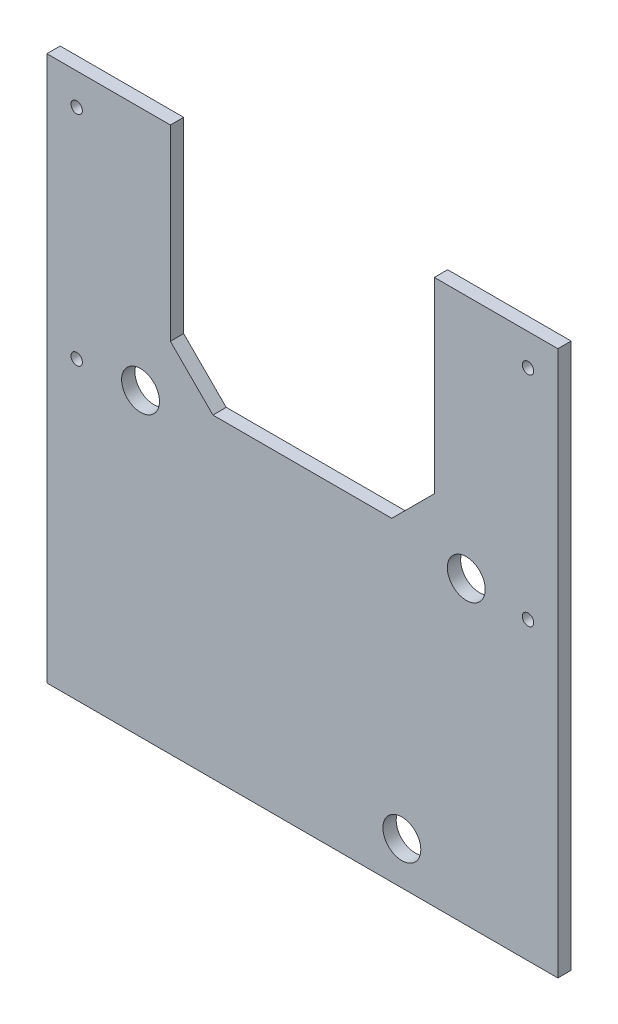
ISO-10303-21;
HEADER;
FILE_DESCRIPTION(('STEP AP214'),'2;1');
FILE_NAME('part.step','',(''),(''),'','','');
FILE_SCHEMA(('AUTOMOTIVE_DESIGN { 1 0 10303 214 1 1 1 1 }'));
ENDSEC;
DATA;
#1=APPLICATION_CONTEXT('core data for automotive mechanical design processes');
#2=APPLICATION_PROTOCOL_DEFINITION('international standard','automotive_design',2000,#1);
#3=PRODUCT_CONTEXT('',#1,'mechanical');
#4=PRODUCT('Part','Part','',(#3));
#5=PRODUCT_RELATED_PRODUCT_CATEGORY('part','',(#4));
#6=PRODUCT_DEFINITION_FORMATION('','',#4);
#7=PRODUCT_DEFINITION_CONTEXT('part definition',#1,'design');
#8=PRODUCT_DEFINITION('design','',#6,#7);
#9=PRODUCT_DEFINITION_SHAPE('','',#8);
#10=(LENGTH_UNIT() NAMED_UNIT(*) SI_UNIT(.MILLI.,.METRE.));
#11=(NAMED_UNIT(*) PLANE_ANGLE_UNIT() SI_UNIT($,.RADIAN.));
#12=(NAMED_UNIT(*) SI_UNIT($,.STERADIAN.) SOLID_ANGLE_UNIT());
#13=UNCERTAINTY_MEASURE_WITH_UNIT(LENGTH_MEASURE(1.E-05),#10,'distance_accuracy_value','');
#14=(GEOMETRIC_REPRESENTATION_CONTEXT(3) GLOBAL_UNCERTAINTY_ASSIGNED_CONTEXT((#13)) GLOBAL_UNIT_ASSIGNED_CONTEXT((#10,
#11,#12)) REPRESENTATION_CONTEXT('',''));
#15=CARTESIAN_POINT('',(0.,0.,0.));
#16=DIRECTION('',(0.,0.,1.));
#17=DIRECTION('',(1.,0.,0.));
#18=AXIS2_PLACEMENT_3D('',#15,#16,#17);
#19=CARTESIAN_POINT('',(-15.24,5.84200000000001,0.));
#20=DIRECTION('',(0.,-1.,0.));
#21=DIRECTION('',(0.,0.,-0.999999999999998));
#22=AXIS2_PLACEMENT_3D('',#19,#20,#21);
#23=PLANE('',#22);
#24=DIRECTION('',(1.,0.,0.));
#25=VECTOR('',#24,1.);
#26=CARTESIAN_POINT('',(-15.24,5.84200000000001,0.793749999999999));
#27=LINE('',#26,#25);
#28=CARTESIAN_POINT('',(-15.24,5.84200000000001,0.793749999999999));
#29=VERTEX_POINT('',#28);
#30=CARTESIAN_POINT('',(-7.87399999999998,5.842,0.79375));
#31=VERTEX_POINT('',#30);
#32=EDGE_CURVE('E210',#29,#31,#27,.T.);
#33=ORIENTED_EDGE('',*,*,#32,.T.);
#34=DIRECTION('',(0.,0.,0.999999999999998));
#35=VECTOR('',#34,1.);
#36=CARTESIAN_POINT('',(-7.87400000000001,5.84200000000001,0.));
#37=LINE('',#36,#35);
#38=CARTESIAN_POINT('',(-7.87400000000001,5.84200000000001,0.));
#39=VERTEX_POINT('',#38);
#40=EDGE_CURVE('E203',#39,#31,#37,.T.);
#41=ORIENTED_EDGE('',*,*,#40,.F.);
#42=DIRECTION('',(1.,0.,0.));
#43=VECTOR('',#42,1.);
#44=CARTESIAN_POINT('',(-15.24,5.84200000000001,0.));
#45=LINE('',#44,#43);
#46=CARTESIAN_POINT('',(-15.24,5.84200000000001,0.));
#47=VERTEX_POINT('',#46);
#48=EDGE_CURVE('E215',#47,#39,#45,.T.);
#49=ORIENTED_EDGE('',*,*,#48,.F.);
#50=DIRECTION('',(0.,0.,0.999999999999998));
#51=VECTOR('',#50,1.);
#52=CARTESIAN_POINT('',(-15.24,5.84200000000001,0.));
#53=LINE('',#52,#51);
#54=EDGE_CURVE('E219',#47,#29,#53,.T.);
#55=ORIENTED_EDGE('',*,*,#54,.T.);
#56=EDGE_LOOP('',(#33,#41,#49,#55));
#57=FACE_BOUND('',#56,.T.);
#58=ADVANCED_FACE('F42',(#57),#23,.F.);
#59=CARTESIAN_POINT('',(-15.24,-20.32,0.793749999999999));
#60=DIRECTION('',(1.,0.,0.));
#61=DIRECTION('',(0.,0.,-0.999999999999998));
#62=AXIS2_PLACEMENT_3D('',#59,#60,#61);
#63=PLANE('',#62);
#64=DIRECTION('',(0.,-1.,0.));
#65=VECTOR('',#64,1.);
#66=CARTESIAN_POINT('',(-15.24,15.24,0.79375));
#67=LINE('',#66,#65);
#68=CARTESIAN_POINT('',(-15.24,-26.67,0.793749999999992));
#69=VERTEX_POINT('',#68);
#70=EDGE_CURVE('E151',#29,#69,#67,.T.);
#71=ORIENTED_EDGE('',*,*,#70,.F.);
#72=ORIENTED_EDGE('',*,*,#54,.F.);
#73=DIRECTION('',(0.,-1.,0.));
#74=VECTOR('',#73,1.);
#75=CARTESIAN_POINT('',(-15.24,-20.32,0.));
#76=LINE('',#75,#74);
#77=CARTESIAN_POINT('',(-15.24,-26.67,0.));
#78=VERTEX_POINT('',#77);
#79=EDGE_CURVE('E222',#47,#78,#76,.T.);
#80=ORIENTED_EDGE('',*,*,#79,.T.);
#81=DIRECTION('',(0.,0.,-0.999999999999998));
#82=VECTOR('',#81,1.);
#83=CARTESIAN_POINT('',(-15.24,-26.67,0.793749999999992));
#84=LINE('',#83,#82);
#85=EDGE_CURVE('E162',#69,#78,#84,.T.);
#86=ORIENTED_EDGE('',*,*,#85,.F.);
#87=EDGE_LOOP('',(#71,#72,#80,#86));
#88=FACE_BOUND('',#87,.T.);
#89=ADVANCED_FACE('F306',(#88),#63,.F.);
#90=CARTESIAN_POINT('',(15.24,15.24,0.793750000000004));
#91=DIRECTION('',(-1.,0.,0.));
#92=DIRECTION('',(0.,-1.,0.));
#93=AXIS2_PLACEMENT_3D('',#90,#91,#92);
#94=PLANE('',#93);
#95=DIRECTION('',(0.,1.,0.));
#96=VECTOR('',#95,1.);
#97=CARTESIAN_POINT('',(15.24,15.24,0.));
#98=LINE('',#97,#96);
#99=CARTESIAN_POINT('',(15.24,-26.67,0.));
#100=VERTEX_POINT('',#99);
#101=CARTESIAN_POINT('',(15.24,5.842,0.));
#102=VERTEX_POINT('',#101);
#103=EDGE_CURVE('E227',#100,#102,#98,.T.);
#104=ORIENTED_EDGE('',*,*,#103,.T.);
#105=DIRECTION('',(0.,0.,0.999999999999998));
#106=VECTOR('',#105,1.);
#107=CARTESIAN_POINT('',(15.24,5.84200000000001,0.));
#108=LINE('',#107,#106);
#109=CARTESIAN_POINT('',(15.24,5.84200000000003,0.79375));
#110=VERTEX_POINT('',#109);
#111=EDGE_CURVE('E147',#102,#110,#108,.T.);
#112=ORIENTED_EDGE('',*,*,#111,.T.);
#113=DIRECTION('',(0.,1.,0.));
#114=VECTOR('',#113,1.);
#115=CARTESIAN_POINT('',(15.24,-15.24,0.793749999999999));
#116=LINE('',#115,#114);
#117=CARTESIAN_POINT('',(15.24,-26.67,0.793749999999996));
#118=VERTEX_POINT('',#117);
#119=EDGE_CURVE('E140',#118,#110,#116,.T.);
#120=ORIENTED_EDGE('',*,*,#119,.F.);
#121=DIRECTION('',(0.,0.,0.999999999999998));
#122=VECTOR('',#121,1.);
#123=CARTESIAN_POINT('',(15.24,-26.67,0.793749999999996));
#124=LINE('',#123,#122);
#125=EDGE_CURVE('E145',#100,#118,#124,.T.);
#126=ORIENTED_EDGE('',*,*,#125,.F.);
#127=EDGE_LOOP('',(#104,#112,#120,#126));
#128=FACE_BOUND('',#127,.T.);
#129=ADVANCED_FACE('F143',(#128),#94,.F.);
#130=CARTESIAN_POINT('',(-15.24,15.24,0.79375));
#131=DIRECTION('',(0.,0.,0.999999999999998));
#132=DIRECTION('',(1.,0.,0.));
#133=AXIS2_PLACEMENT_3D('',#130,#131,#132);
#134=PLANE('',#133);
#135=CARTESIAN_POINT('',(-13.462,-9.04000000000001,0.793749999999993));
#136=DIRECTION('',(0.,0.,0.999999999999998));
#137=DIRECTION('',(1.,0.,0.));
#138=AXIS2_PLACEMENT_3D('',#135,#136,#137);
#139=CIRCLE('',#138,0.339377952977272);
#140=CARTESIAN_POINT('',(-13.1226220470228,-9.04000000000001,0.793749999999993));
#141=VERTEX_POINT('',#140);
#142=EDGE_CURVE('E258',#141,#141,#139,.T.);
#143=ORIENTED_EDGE('',*,*,#142,.F.);
#144=EDGE_LOOP('',(#143));
#145=FACE_BOUND('',#144,.T.);
#146=CARTESIAN_POINT('',(-13.462,3.96000000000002,0.793749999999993));
#147=DIRECTION('',(0.,0.,0.999999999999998));
#148=DIRECTION('',(1.,0.,0.));
#149=AXIS2_PLACEMENT_3D('',#146,#147,#148);
#150=CIRCLE('',#149,0.339377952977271);
#151=CARTESIAN_POINT('',(-13.1226220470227,3.96000000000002,0.793749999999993));
#152=VERTEX_POINT('',#151);
#153=EDGE_CURVE('E257',#152,#152,#150,.T.);
#154=ORIENTED_EDGE('',*,*,#153,.F.);
#155=EDGE_LOOP('',(#154));
#156=FACE_BOUND('',#155,.T.);
#157=CARTESIAN_POINT('',(13.462,3.96000000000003,0.793749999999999));
#158=DIRECTION('',(0.,0.,0.999999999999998));
#159=DIRECTION('',(1.,0.,0.));
#160=AXIS2_PLACEMENT_3D('',#157,#158,#159);
#161=CIRCLE('',#160,0.339377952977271);
#162=CARTESIAN_POINT('',(13.8013779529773,3.96000000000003,0.793749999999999));
#163=VERTEX_POINT('',#162);
#164=EDGE_CURVE('E268',#163,#163,#161,.T.);
#165=ORIENTED_EDGE('',*,*,#164,.F.);
#166=EDGE_LOOP('',(#165));
#167=FACE_BOUND('',#166,.T.);
#168=CARTESIAN_POINT('',(13.462,-9.03999999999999,0.793749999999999));
#169=DIRECTION('',(0.,0.,0.999999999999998));
#170=DIRECTION('',(1.,0.,0.));
#171=AXIS2_PLACEMENT_3D('',#168,#169,#170);
#172=CIRCLE('',#171,0.339377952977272);
#173=CARTESIAN_POINT('',(13.8013779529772,-9.04000000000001,0.793749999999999));
#174=VERTEX_POINT('',#173);
#175=EDGE_CURVE('E267',#174,#174,#172,.T.);
#176=ORIENTED_EDGE('',*,*,#175,.F.);
#177=EDGE_LOOP('',(#176));
#178=FACE_BOUND('',#177,.T.);
#179=CARTESIAN_POINT('',(9.77899999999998,-8.76299999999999,0.793749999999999));
#180=DIRECTION('',(0.,0.,0.999999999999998));
#181=DIRECTION('',(1.,0.,0.));
#182=AXIS2_PLACEMENT_3D('',#179,#180,#181);
#183=CIRCLE('',#182,1.1303);
#184=CARTESIAN_POINT('',(10.9093,-8.76299999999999,0.793749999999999));
#185=VERTEX_POINT('',#184);
#186=EDGE_CURVE('E506',#185,#185,#183,.T.);
#187=ORIENTED_EDGE('',*,*,#186,.F.);
#188=EDGE_LOOP('',(#187));
#189=FACE_BOUND('',#188,.T.);
#190=CARTESIAN_POINT('',(5.93598000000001,-24.13,0.793749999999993));
#191=DIRECTION('',(0.,0.,0.999999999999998));
#192=DIRECTION('',(1.,0.,0.));
#193=AXIS2_PLACEMENT_3D('',#190,#191,#192);
#194=CIRCLE('',#193,1.1303);
#195=CARTESIAN_POINT('',(7.06628000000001,-24.13,0.793749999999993));
#196=VERTEX_POINT('',#195);
#197=EDGE_CURVE('E252',#196,#196,#194,.T.);
#198=ORIENTED_EDGE('',*,*,#197,.F.);
#199=EDGE_LOOP('',(#198));
#200=FACE_BOUND('',#199,.T.);
#201=CARTESIAN_POINT('',(-9.652,-8.76300000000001,0.793749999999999));
#202=DIRECTION('',(0.,0.,0.999999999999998));
#203=DIRECTION('',(1.,0.,0.));
#204=AXIS2_PLACEMENT_3D('',#201,#202,#203);
#205=CIRCLE('',#204,1.1303);
#206=CARTESIAN_POINT('',(-8.5217,-8.76300000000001,0.793749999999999));
#207=VERTEX_POINT('',#206);
#208=EDGE_CURVE('E169',#207,#207,#205,.T.);
#209=ORIENTED_EDGE('',*,*,#208,.F.);
#210=EDGE_LOOP('',(#209));
#211=FACE_BOUND('',#210,.T.);
#212=DIRECTION('',(0.,-1.,0.));
#213=VECTOR('',#212,1.);
#214=CARTESIAN_POINT('',(-7.87399999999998,5.842,0.79375));
#215=LINE('',#214,#213);
#216=CARTESIAN_POINT('',(-7.87400000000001,-5.334,0.79375));
#217=VERTEX_POINT('',#216);
#218=EDGE_CURVE('E182',#31,#217,#215,.T.);
#219=ORIENTED_EDGE('',*,*,#218,.F.);
#220=ORIENTED_EDGE('',*,*,#32,.F.);
#221=ORIENTED_EDGE('',*,*,#70,.T.);
#222=DIRECTION('',(-1.,0.,0.));
#223=VECTOR('',#222,1.);
#224=CARTESIAN_POINT('',(15.24,-26.67,0.793749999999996));
#225=LINE('',#224,#223);
#226=EDGE_CURVE('E154',#118,#69,#225,.T.);
#227=ORIENTED_EDGE('',*,*,#226,.F.);
#228=ORIENTED_EDGE('',*,*,#119,.T.);
#229=CARTESIAN_POINT('',(7.87400000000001,5.842,0.793749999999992));
#230=VERTEX_POINT('',#229);
#231=EDGE_CURVE('E206',#230,#110,#27,.T.);
#232=ORIENTED_EDGE('',*,*,#231,.F.);
#233=DIRECTION('',(0.,1.,0.));
#234=VECTOR('',#233,1.);
#235=CARTESIAN_POINT('',(7.87400000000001,5.842,0.793749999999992));
#236=LINE('',#235,#234);
#237=CARTESIAN_POINT('',(7.87399999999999,-5.33399999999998,0.793749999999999));
#238=VERTEX_POINT('',#237);
#239=EDGE_CURVE('E189',#238,#230,#236,.T.);
#240=ORIENTED_EDGE('',*,*,#239,.F.);
#241=DIRECTION('',(0.707106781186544,0.707106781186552,0.));
#242=VECTOR('',#241,1.);
#243=CARTESIAN_POINT('',(7.87399999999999,-5.33399999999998,0.793749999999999));
#244=LINE('',#243,#242);
#245=CARTESIAN_POINT('',(5.33400000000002,-7.87400000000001,0.793750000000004));
#246=VERTEX_POINT('',#245);
#247=EDGE_CURVE('E244',#238,#246,#244,.F.);
#248=ORIENTED_EDGE('',*,*,#247,.T.);
#249=DIRECTION('',(1.,0.,0.));
#250=VECTOR('',#249,1.);
#251=CARTESIAN_POINT('',(-7.874,-7.87399999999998,0.793749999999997));
#252=LINE('',#251,#250);
#253=CARTESIAN_POINT('',(-5.334,-7.87399999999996,0.793749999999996));
#254=VERTEX_POINT('',#253);
#255=EDGE_CURVE('E185',#254,#246,#252,.T.);
#256=ORIENTED_EDGE('',*,*,#255,.F.);
#257=DIRECTION('',(0.707106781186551,-0.707106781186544,0.));
#258=VECTOR('',#257,1.);
#259=CARTESIAN_POINT('',(-5.334,-7.87399999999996,0.793749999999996));
#260=LINE('',#259,#258);
#261=EDGE_CURVE('E51',#254,#217,#260,.F.);
#262=ORIENTED_EDGE('',*,*,#261,.T.);
#263=EDGE_LOOP('',(#219,#220,#221,#227,#228,#232,#240,#248,#256,#262));
#264=FACE_BOUND('',#263,.T.);
#265=ADVANCED_FACE('F155',(#145,#156,#167,#178,#189,#200,#211,#264),#134,.T.);
#266=CARTESIAN_POINT('',(-15.24,15.24,0.));
#267=DIRECTION('',(0.,0.,0.999999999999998));
#268=DIRECTION('',(1.,0.,0.));
#269=AXIS2_PLACEMENT_3D('',#266,#267,#268);
#270=PLANE('',#269);
#271=CARTESIAN_POINT('',(-13.462,-9.04000000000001,0.));
#272=DIRECTION('',(0.,0.,0.999999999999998));
#273=DIRECTION('',(1.,0.,0.));
#274=AXIS2_PLACEMENT_3D('',#271,#272,#273);
#275=CIRCLE('',#274,0.339377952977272);
#276=CARTESIAN_POINT('',(-13.1226220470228,-9.04000000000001,0.));
#277=VERTEX_POINT('',#276);
#278=EDGE_CURVE('E254',#277,#277,#275,.T.);
#279=ORIENTED_EDGE('',*,*,#278,.T.);
#280=EDGE_LOOP('',(#279));
#281=FACE_BOUND('',#280,.T.);
#282=CARTESIAN_POINT('',(-13.462,3.96000000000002,0.));
#283=DIRECTION('',(0.,0.,0.999999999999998));
#284=DIRECTION('',(1.,0.,0.));
#285=AXIS2_PLACEMENT_3D('',#282,#283,#284);
#286=CIRCLE('',#285,0.339377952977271);
#287=CARTESIAN_POINT('',(-13.1226220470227,3.96000000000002,0.));
#288=VERTEX_POINT('',#287);
#289=EDGE_CURVE('E271',#288,#288,#286,.T.);
#290=ORIENTED_EDGE('',*,*,#289,.T.);
#291=EDGE_LOOP('',(#290));
#292=FACE_BOUND('',#291,.T.);
#293=CARTESIAN_POINT('',(13.462,3.96000000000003,0.));
#294=DIRECTION('',(0.,0.,0.999999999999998));
#295=DIRECTION('',(1.,0.,0.));
#296=AXIS2_PLACEMENT_3D('',#293,#294,#295);
#297=CIRCLE('',#296,0.339377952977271);
#298=CARTESIAN_POINT('',(13.8013779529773,3.96000000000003,0.));
#299=VERTEX_POINT('',#298);
#300=EDGE_CURVE('E264',#299,#299,#297,.T.);
#301=ORIENTED_EDGE('',*,*,#300,.T.);
#302=EDGE_LOOP('',(#301));
#303=FACE_BOUND('',#302,.T.);
#304=CARTESIAN_POINT('',(13.462,-9.04000000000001,0.));
#305=DIRECTION('',(0.,0.,0.999999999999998));
#306=DIRECTION('',(1.,0.,0.));
#307=AXIS2_PLACEMENT_3D('',#304,#305,#306);
#308=CIRCLE('',#307,0.339377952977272);
#309=CARTESIAN_POINT('',(13.8013779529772,-9.04000000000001,0.));
#310=VERTEX_POINT('',#309);
#311=EDGE_CURVE('E526',#310,#310,#308,.T.);
#312=ORIENTED_EDGE('',*,*,#311,.T.);
#313=EDGE_LOOP('',(#312));
#314=FACE_BOUND('',#313,.T.);
#315=CARTESIAN_POINT('',(9.77899999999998,-8.76299999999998,0.));
#316=DIRECTION('',(0.,0.,0.999999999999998));
#317=DIRECTION('',(1.,0.,0.));
#318=AXIS2_PLACEMENT_3D('',#315,#316,#317);
#319=CIRCLE('',#318,1.1303);
#320=CARTESIAN_POINT('',(10.9093,-8.76299999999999,0.));
#321=VERTEX_POINT('',#320);
#322=EDGE_CURVE('E522',#321,#321,#319,.T.);
#323=ORIENTED_EDGE('',*,*,#322,.T.);
#324=EDGE_LOOP('',(#323));
#325=FACE_BOUND('',#324,.T.);
#326=CARTESIAN_POINT('',(5.93597999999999,-24.13,0.));
#327=DIRECTION('',(0.,0.,0.999999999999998));
#328=DIRECTION('',(1.,0.,0.));
#329=AXIS2_PLACEMENT_3D('',#326,#327,#328);
#330=CIRCLE('',#329,1.1303);
#331=CARTESIAN_POINT('',(7.06628000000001,-24.13,0.));
#332=VERTEX_POINT('',#331);
#333=EDGE_CURVE('E514',#332,#332,#330,.T.);
#334=ORIENTED_EDGE('',*,*,#333,.T.);
#335=EDGE_LOOP('',(#334));
#336=FACE_BOUND('',#335,.T.);
#337=CARTESIAN_POINT('',(-9.65200000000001,-8.76299999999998,0.));
#338=DIRECTION('',(0.,0.,0.999999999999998));
#339=DIRECTION('',(1.,0.,0.));
#340=AXIS2_PLACEMENT_3D('',#337,#338,#339);
#341=CIRCLE('',#340,1.1303);
#342=CARTESIAN_POINT('',(-8.5217,-8.76300000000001,0.));
#343=VERTEX_POINT('',#342);
#344=EDGE_CURVE('E174',#343,#343,#341,.T.);
#345=ORIENTED_EDGE('',*,*,#344,.T.);
#346=EDGE_LOOP('',(#345));
#347=FACE_BOUND('',#346,.T.);
#348=ORIENTED_EDGE('',*,*,#48,.T.);
#349=DIRECTION('',(0.,-1.,0.));
#350=VECTOR('',#349,1.);
#351=CARTESIAN_POINT('',(-7.87400000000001,5.84200000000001,0.));
#352=LINE('',#351,#350);
#353=CARTESIAN_POINT('',(-7.87400000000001,-5.334,0.));
#354=VERTEX_POINT('',#353);
#355=EDGE_CURVE('E192',#39,#354,#352,.T.);
#356=ORIENTED_EDGE('',*,*,#355,.T.);
#357=DIRECTION('',(-0.707106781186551,0.707106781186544,0.));
#358=VECTOR('',#357,1.);
#359=CARTESIAN_POINT('',(-21.8440000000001,8.63599999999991,0.));
#360=LINE('',#359,#358);
#361=CARTESIAN_POINT('',(-5.334,-7.87399999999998,0.));
#362=VERTEX_POINT('',#361);
#363=EDGE_CURVE('E11',#354,#362,#360,.F.);
#364=ORIENTED_EDGE('',*,*,#363,.T.);
#365=DIRECTION('',(1.,0.,0.));
#366=VECTOR('',#365,1.);
#367=CARTESIAN_POINT('',(-7.87400000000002,-7.87399999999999,0.));
#368=LINE('',#367,#366);
#369=CARTESIAN_POINT('',(5.33399999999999,-7.87399999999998,0.));
#370=VERTEX_POINT('',#369);
#371=EDGE_CURVE('E195',#362,#370,#368,.T.);
#372=ORIENTED_EDGE('',*,*,#371,.T.);
#373=DIRECTION('',(-0.707106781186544,-0.707106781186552,0.));
#374=VECTOR('',#373,1.);
#375=CARTESIAN_POINT('',(6.60400000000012,-6.60399999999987,0.));
#376=LINE('',#375,#374);
#377=CARTESIAN_POINT('',(7.87399999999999,-5.33399999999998,0.));
#378=VERTEX_POINT('',#377);
#379=EDGE_CURVE('E247',#370,#378,#376,.F.);
#380=ORIENTED_EDGE('',*,*,#379,.T.);
#381=DIRECTION('',(0.,1.,0.));
#382=VECTOR('',#381,1.);
#383=CARTESIAN_POINT('',(7.87399999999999,5.842,0.));
#384=LINE('',#383,#382);
#385=CARTESIAN_POINT('',(7.87399999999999,5.842,0.));
#386=VERTEX_POINT('',#385);
#387=EDGE_CURVE('E199',#378,#386,#384,.T.);
#388=ORIENTED_EDGE('',*,*,#387,.T.);
#389=EDGE_CURVE('E214',#386,#102,#45,.T.);
#390=ORIENTED_EDGE('',*,*,#389,.T.);
#391=ORIENTED_EDGE('',*,*,#103,.F.);
#392=DIRECTION('',(1.,0.,0.));
#393=VECTOR('',#392,1.);
#394=CARTESIAN_POINT('',(15.24,-26.67,0.));
#395=LINE('',#394,#393);
#396=EDGE_CURVE('E167',#78,#100,#395,.T.);
#397=ORIENTED_EDGE('',*,*,#396,.F.);
#398=ORIENTED_EDGE('',*,*,#79,.F.);
#399=EDGE_LOOP('',(#348,#356,#364,#372,#380,#388,#390,#391,#397,#398));
#400=FACE_BOUND('',#399,.T.);
#401=ADVANCED_FACE('F281',(#281,#292,#303,#314,#325,#336,#347,#400),#270,.F.);
#402=ORIENTED_EDGE('',*,*,#389,.F.);
#403=DIRECTION('',(0.,0.,0.999999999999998));
#404=VECTOR('',#403,1.);
#405=CARTESIAN_POINT('',(7.87399999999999,5.842,0.));
#406=LINE('',#405,#404);
#407=EDGE_CURVE('E202',#386,#230,#406,.T.);
#408=ORIENTED_EDGE('',*,*,#407,.T.);
#409=ORIENTED_EDGE('',*,*,#231,.T.);
#410=ORIENTED_EDGE('',*,*,#111,.F.);
#411=EDGE_LOOP('',(#402,#408,#409,#410));
#412=FACE_BOUND('',#411,.T.);
#413=ADVANCED_FACE('F285',(#412),#23,.F.);
#414=CARTESIAN_POINT('',(-7.87400000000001,5.84200000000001,0.));
#415=DIRECTION('',(-1.,0.,0.));
#416=DIRECTION('',(0.,0.,0.999999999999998));
#417=AXIS2_PLACEMENT_3D('',#414,#415,#416);
#418=PLANE('',#417);
#419=ORIENTED_EDGE('',*,*,#218,.T.);
#420=DIRECTION('',(0.,0.,-0.999999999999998));
#421=VECTOR('',#420,1.);
#422=CARTESIAN_POINT('',(-7.87400000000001,-5.334,0.));
#423=LINE('',#422,#421);
#424=EDGE_CURVE('E61',#217,#354,#423,.T.);
#425=ORIENTED_EDGE('',*,*,#424,.T.);
#426=ORIENTED_EDGE('',*,*,#355,.F.);
#427=ORIENTED_EDGE('',*,*,#40,.T.);
#428=EDGE_LOOP('',(#419,#425,#426,#427));
#429=FACE_BOUND('',#428,.T.);
#430=ADVANCED_FACE('F317',(#429),#418,.F.);
#431=CARTESIAN_POINT('',(7.87399999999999,5.842,0.));
#432=DIRECTION('',(1.,0.,0.));
#433=DIRECTION('',(0.,0.,-0.999999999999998));
#434=AXIS2_PLACEMENT_3D('',#431,#432,#433);
#435=PLANE('',#434);
#436=ORIENTED_EDGE('',*,*,#387,.F.);
#437=DIRECTION('',(0.,0.,0.999999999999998));
#438=VECTOR('',#437,1.);
#439=CARTESIAN_POINT('',(7.87399999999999,-5.33399999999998,0.793749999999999));
#440=LINE('',#439,#438);
#441=EDGE_CURVE('E150',#378,#238,#440,.T.);
#442=ORIENTED_EDGE('',*,*,#441,.T.);
#443=ORIENTED_EDGE('',*,*,#239,.T.);
#444=ORIENTED_EDGE('',*,*,#407,.F.);
#445=EDGE_LOOP('',(#436,#442,#443,#444));
#446=FACE_BOUND('',#445,.T.);
#447=ADVANCED_FACE('F288',(#446),#435,.F.);
#448=CARTESIAN_POINT('',(-7.87400000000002,-7.87399999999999,0.));
#449=DIRECTION('',(0.,-1.,0.));
#450=DIRECTION('',(0.,0.,-0.999999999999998));
#451=AXIS2_PLACEMENT_3D('',#448,#449,#450);
#452=PLANE('',#451);
#453=ORIENTED_EDGE('',*,*,#255,.T.);
#454=DIRECTION('',(0.,0.,-0.999999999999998));
#455=VECTOR('',#454,1.);
#456=CARTESIAN_POINT('',(5.33399999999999,-7.87399999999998,0.));
#457=LINE('',#456,#455);
#458=EDGE_CURVE('E239',#246,#370,#457,.T.);
#459=ORIENTED_EDGE('',*,*,#458,.T.);
#460=ORIENTED_EDGE('',*,*,#371,.F.);
#461=DIRECTION('',(0.,0.,0.999999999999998));
#462=VECTOR('',#461,1.);
#463=CARTESIAN_POINT('',(-5.334,-7.87399999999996,0.793749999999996));
#464=LINE('',#463,#462);
#465=EDGE_CURVE('E235',#362,#254,#464,.T.);
#466=ORIENTED_EDGE('',*,*,#465,.T.);
#467=EDGE_LOOP('',(#453,#459,#460,#466));
#468=FACE_BOUND('',#467,.T.);
#469=ADVANCED_FACE('F296',(#468),#452,.F.);
#470=CARTESIAN_POINT('',(15.24,-26.67,0.));
#471=DIRECTION('',(0.,1.,0.));
#472=DIRECTION('',(0.,0.,0.999999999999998));
#473=AXIS2_PLACEMENT_3D('',#470,#471,#472);
#474=PLANE('',#473);
#475=ORIENTED_EDGE('',*,*,#125,.T.);
#476=ORIENTED_EDGE('',*,*,#226,.T.);
#477=ORIENTED_EDGE('',*,*,#85,.T.);
#478=ORIENTED_EDGE('',*,*,#396,.T.);
#479=EDGE_LOOP('',(#475,#476,#477,#478));
#480=FACE_BOUND('',#479,.T.);
#481=ADVANCED_FACE('F165',(#480),#474,.F.);
#482=CARTESIAN_POINT('',(-9.652,-8.76300000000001,0.793749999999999));
#483=DIRECTION('',(0.,0.,0.999999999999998));
#484=DIRECTION('',(1.,0.,0.));
#485=AXIS2_PLACEMENT_3D('',#482,#483,#484);
#486=CYLINDRICAL_SURFACE('',#485,1.1303);
#487=CARTESIAN_POINT('',(-8.5217,-8.76300000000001,0.));
#488=CARTESIAN_POINT('',(-8.5217,-8.76300000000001,0.00826822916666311));
#489=CARTESIAN_POINT('',(-8.5217,-8.76300000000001,0.0165364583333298));
#490=CARTESIAN_POINT('',(-8.5217,-8.76300000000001,0.0330729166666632));
#491=CARTESIAN_POINT('',(-8.5217,-8.76300000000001,0.04134114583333));
#492=CARTESIAN_POINT('',(-8.5217,-8.76300000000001,0.0578776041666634));
#493=CARTESIAN_POINT('',(-8.5217,-8.76300000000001,0.06614583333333));
#494=CARTESIAN_POINT('',(-8.5217,-8.76300000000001,0.0826822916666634));
#495=CARTESIAN_POINT('',(-8.5217,-8.76300000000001,0.0909505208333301));
#496=CARTESIAN_POINT('',(-8.5217,-8.76300000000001,0.107486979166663));
#497=CARTESIAN_POINT('',(-8.5217,-8.76300000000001,0.11575520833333));
#498=CARTESIAN_POINT('',(-8.5217,-8.76300000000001,0.132291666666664));
#499=CARTESIAN_POINT('',(-8.5217,-8.76300000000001,0.14055989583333));
#500=CARTESIAN_POINT('',(-8.5217,-8.76300000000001,0.157096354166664));
#501=CARTESIAN_POINT('',(-8.5217,-8.76300000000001,0.16536458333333));
#502=CARTESIAN_POINT('',(-8.5217,-8.76300000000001,0.181901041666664));
#503=CARTESIAN_POINT('',(-8.5217,-8.76300000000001,0.19016927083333));
#504=CARTESIAN_POINT('',(-8.5217,-8.76300000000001,0.206705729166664));
#505=CARTESIAN_POINT('',(-8.5217,-8.76300000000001,0.214973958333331));
#506=CARTESIAN_POINT('',(-8.5217,-8.76300000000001,0.231510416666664));
#507=CARTESIAN_POINT('',(-8.5217,-8.76300000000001,0.239778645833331));
#508=CARTESIAN_POINT('',(-8.5217,-8.76300000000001,0.256315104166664));
#509=CARTESIAN_POINT('',(-8.5217,-8.76300000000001,0.264583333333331));
#510=CARTESIAN_POINT('',(-8.5217,-8.76300000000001,0.281119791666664));
#511=CARTESIAN_POINT('',(-8.5217,-8.76300000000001,0.289388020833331));
#512=CARTESIAN_POINT('',(-8.5217,-8.76300000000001,0.305924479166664));
#513=CARTESIAN_POINT('',(-8.5217,-8.76300000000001,0.314192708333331));
#514=CARTESIAN_POINT('',(-8.5217,-8.76300000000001,0.330729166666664));
#515=CARTESIAN_POINT('',(-8.5217,-8.76300000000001,0.338997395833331));
#516=CARTESIAN_POINT('',(-8.5217,-8.76300000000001,0.355533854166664));
#517=CARTESIAN_POINT('',(-8.5217,-8.76300000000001,0.363802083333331));
#518=CARTESIAN_POINT('',(-8.5217,-8.76300000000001,0.380338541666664));
#519=CARTESIAN_POINT('',(-8.5217,-8.76300000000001,0.388606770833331));
#520=CARTESIAN_POINT('',(-8.5217,-8.76300000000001,0.405143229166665));
#521=CARTESIAN_POINT('',(-8.5217,-8.76300000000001,0.413411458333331));
#522=CARTESIAN_POINT('',(-8.5217,-8.76300000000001,0.429947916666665));
#523=CARTESIAN_POINT('',(-8.5217,-8.76300000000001,0.438216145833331));
#524=CARTESIAN_POINT('',(-8.5217,-8.76300000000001,0.454752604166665));
#525=CARTESIAN_POINT('',(-8.5217,-8.76300000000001,0.463020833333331));
#526=CARTESIAN_POINT('',(-8.5217,-8.76300000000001,0.479557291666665));
#527=CARTESIAN_POINT('',(-8.5217,-8.76300000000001,0.487825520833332));
#528=CARTESIAN_POINT('',(-8.5217,-8.76300000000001,0.504361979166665));
#529=CARTESIAN_POINT('',(-8.5217,-8.76300000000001,0.512630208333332));
#530=CARTESIAN_POINT('',(-8.5217,-8.76300000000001,0.529166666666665));
#531=CARTESIAN_POINT('',(-8.5217,-8.76300000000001,0.537434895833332));
#532=CARTESIAN_POINT('',(-8.5217,-8.76300000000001,0.553971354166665));
#533=CARTESIAN_POINT('',(-8.5217,-8.76300000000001,0.562239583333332));
#534=CARTESIAN_POINT('',(-8.5217,-8.76300000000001,0.578776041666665));
#535=CARTESIAN_POINT('',(-8.5217,-8.76300000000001,0.587044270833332));
#536=CARTESIAN_POINT('',(-8.5217,-8.76300000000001,0.603580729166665));
#537=CARTESIAN_POINT('',(-8.5217,-8.76300000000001,0.611848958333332));
#538=CARTESIAN_POINT('',(-8.5217,-8.76300000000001,0.628385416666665));
#539=CARTESIAN_POINT('',(-8.5217,-8.76300000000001,0.636653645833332));
#540=CARTESIAN_POINT('',(-8.5217,-8.76300000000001,0.653190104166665));
#541=CARTESIAN_POINT('',(-8.5217,-8.76300000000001,0.661458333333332));
#542=CARTESIAN_POINT('',(-8.5217,-8.76300000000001,0.677994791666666));
#543=CARTESIAN_POINT('',(-8.5217,-8.76300000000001,0.686263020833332));
#544=CARTESIAN_POINT('',(-8.5217,-8.76300000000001,0.702799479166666));
#545=CARTESIAN_POINT('',(-8.5217,-8.76300000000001,0.711067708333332));
#546=CARTESIAN_POINT('',(-8.5217,-8.76300000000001,0.727604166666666));
#547=CARTESIAN_POINT('',(-8.5217,-8.76300000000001,0.735872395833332));
#548=CARTESIAN_POINT('',(-8.5217,-8.76300000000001,0.752408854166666));
#549=CARTESIAN_POINT('',(-8.5217,-8.76300000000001,0.760677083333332));
#550=CARTESIAN_POINT('',(-8.5217,-8.76300000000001,0.777213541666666));
#551=CARTESIAN_POINT('',(-8.5217,-8.76300000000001,0.785481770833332));
#552=CARTESIAN_POINT('',(-8.5217,-8.76300000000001,0.793749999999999));
#553=B_SPLINE_CURVE_WITH_KNOTS('',3,(#487,#488,#489,#490,#491,#492,#493,#494,#495,#496,#497,
#498,#499,#500,#501,#502,#503,#504,#505,#506,#507,#508,#509,#510,#511,#512,#513,#514,#515,#516,
#517,#518,#519,#520,#521,#522,#523,#524,#525,#526,#527,#528,#529,#530,#531,#532,#533,#534,#535,
#536,#537,#538,#539,#540,#541,#542,#543,#544,#545,#546,#547,#548,#549,#550,#551,#552),
.UNSPECIFIED.,.F.,.F.,(4,2,2,2,2,2,2,2,2,2,2,2,2,2,2,2,2,2,2,2,2,2,2,2,2,2,2,2,2,2,2,2,4),(0.,
0.0248046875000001,0.0496093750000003,0.0744140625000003,0.0992187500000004,0.124023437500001,
0.148828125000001,0.173632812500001,0.198437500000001,0.223242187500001,0.248046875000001,
0.272851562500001,0.297656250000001,0.322460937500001,0.347265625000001,0.372070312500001,
0.396875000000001,0.421679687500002,0.446484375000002,0.471289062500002,0.496093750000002,
0.520898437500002,0.545703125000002,0.570507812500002,0.595312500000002,0.620117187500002,
0.644921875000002,0.669726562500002,0.694531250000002,0.719335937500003,0.744140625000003,
0.768945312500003,0.793750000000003),.UNSPECIFIED.);
#554=EDGE_CURVE('BSEAM369',#343,#207,#553,.T.);
#555=ORIENTED_EDGE('',*,*,#344,.F.);
#556=ORIENTED_EDGE('',*,*,#208,.T.);
#557=ORIENTED_EDGE('',*,*,#554,.T.);
#558=ORIENTED_EDGE('',*,*,#554,.F.);
#559=EDGE_LOOP('',(#555,#557,#556,#558));
#560=FACE_BOUND('',#559,.T.);
#561=ADVANCED_FACE('F369',(#560),#486,.F.);
#562=CARTESIAN_POINT('',(5.93598000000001,-24.13,0.793749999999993));
#563=DIRECTION('',(0.,0.,0.999999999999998));
#564=DIRECTION('',(1.,0.,0.));
#565=AXIS2_PLACEMENT_3D('',#562,#563,#564);
#566=CYLINDRICAL_SURFACE('',#565,1.1303);
#567=CARTESIAN_POINT('',(7.06628000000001,-24.13,0.));
#568=CARTESIAN_POINT('',(7.06628000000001,-24.13,0.00826822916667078));
#569=CARTESIAN_POINT('',(7.06628000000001,-24.13,0.0165364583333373));
#570=CARTESIAN_POINT('',(7.06628000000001,-24.13,0.0330729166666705));
#571=CARTESIAN_POINT('',(7.06628000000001,-24.13,0.0413411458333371));
#572=CARTESIAN_POINT('',(7.06628000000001,-24.13,0.0578776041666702));
#573=CARTESIAN_POINT('',(7.06628000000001,-24.13,0.0661458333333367));
#574=CARTESIAN_POINT('',(7.06628000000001,-24.13,0.0826822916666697));
#575=CARTESIAN_POINT('',(7.06628000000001,-24.13,0.0909505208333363));
#576=CARTESIAN_POINT('',(7.06628000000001,-24.13,0.107486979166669));
#577=CARTESIAN_POINT('',(7.06628000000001,-24.13,0.115755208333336));
#578=CARTESIAN_POINT('',(7.06628000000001,-24.13,0.132291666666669));
#579=CARTESIAN_POINT('',(7.06628000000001,-24.13,0.140559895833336));
#580=CARTESIAN_POINT('',(7.06628000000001,-24.13,0.157096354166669));
#581=CARTESIAN_POINT('',(7.06628000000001,-24.13,0.165364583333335));
#582=CARTESIAN_POINT('',(7.06628000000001,-24.13,0.181901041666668));
#583=CARTESIAN_POINT('',(7.06628000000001,-24.13,0.190169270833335));
#584=CARTESIAN_POINT('',(7.06628000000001,-24.13,0.206705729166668));
#585=CARTESIAN_POINT('',(7.06628000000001,-24.13,0.214973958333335));
#586=CARTESIAN_POINT('',(7.06628000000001,-24.13,0.231510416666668));
#587=CARTESIAN_POINT('',(7.06628000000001,-24.13,0.239778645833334));
#588=CARTESIAN_POINT('',(7.06628000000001,-24.13,0.256315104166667));
#589=CARTESIAN_POINT('',(7.06628000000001,-24.13,0.264583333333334));
#590=CARTESIAN_POINT('',(7.06628000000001,-24.13,0.281119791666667));
#591=CARTESIAN_POINT('',(7.06628000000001,-24.13,0.289388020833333));
#592=CARTESIAN_POINT('',(7.06628000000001,-24.13,0.305924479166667));
#593=CARTESIAN_POINT('',(7.06628000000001,-24.13,0.314192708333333));
#594=CARTESIAN_POINT('',(7.06628000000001,-24.13,0.330729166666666));
#595=CARTESIAN_POINT('',(7.06628000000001,-24.13,0.338997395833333));
#596=CARTESIAN_POINT('',(7.06628000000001,-24.13,0.355533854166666));
#597=CARTESIAN_POINT('',(7.06628000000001,-24.13,0.363802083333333));
#598=CARTESIAN_POINT('',(7.06628000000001,-24.13,0.380338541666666));
#599=CARTESIAN_POINT('',(7.06628000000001,-24.13,0.388606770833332));
#600=CARTESIAN_POINT('',(7.06628000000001,-24.13,0.405143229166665));
#601=CARTESIAN_POINT('',(7.06628000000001,-24.13,0.413411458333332));
#602=CARTESIAN_POINT('',(7.06628000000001,-24.13,0.429947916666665));
#603=CARTESIAN_POINT('',(7.06628000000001,-24.13,0.438216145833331));
#604=CARTESIAN_POINT('',(7.06628000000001,-24.13,0.454752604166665));
#605=CARTESIAN_POINT('',(7.06628000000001,-24.13,0.463020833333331));
#606=CARTESIAN_POINT('',(7.06628000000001,-24.13,0.479557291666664));
#607=CARTESIAN_POINT('',(7.06628000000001,-24.13,0.487825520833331));
#608=CARTESIAN_POINT('',(7.06628000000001,-24.13,0.504361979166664));
#609=CARTESIAN_POINT('',(7.06628000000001,-24.13,0.51263020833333));
#610=CARTESIAN_POINT('',(7.06628000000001,-24.13,0.529166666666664));
#611=CARTESIAN_POINT('',(7.06628000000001,-24.13,0.53743489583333));
#612=CARTESIAN_POINT('',(7.06628000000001,-24.13,0.553971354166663));
#613=CARTESIAN_POINT('',(7.06628000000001,-24.13,0.56223958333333));
#614=CARTESIAN_POINT('',(7.06628000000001,-24.13,0.578776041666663));
#615=CARTESIAN_POINT('',(7.06628000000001,-24.13,0.587044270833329));
#616=CARTESIAN_POINT('',(7.06628000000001,-24.13,0.603580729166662));
#617=CARTESIAN_POINT('',(7.06628000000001,-24.13,0.611848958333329));
#618=CARTESIAN_POINT('',(7.06628000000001,-24.13,0.628385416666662));
#619=CARTESIAN_POINT('',(7.06628000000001,-24.13,0.636653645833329));
#620=CARTESIAN_POINT('',(7.06628000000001,-24.13,0.653190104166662));
#621=CARTESIAN_POINT('',(7.06628000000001,-24.13,0.661458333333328));
#622=CARTESIAN_POINT('',(7.06628000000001,-24.13,0.677994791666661));
#623=CARTESIAN_POINT('',(7.06628000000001,-24.13,0.686263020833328));
#624=CARTESIAN_POINT('',(7.06628000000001,-24.13,0.702799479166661));
#625=CARTESIAN_POINT('',(7.06628000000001,-24.13,0.711067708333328));
#626=CARTESIAN_POINT('',(7.06628000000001,-24.13,0.727604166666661));
#627=CARTESIAN_POINT('',(7.06628000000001,-24.13,0.735872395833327));
#628=CARTESIAN_POINT('',(7.06628000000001,-24.13,0.75240885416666));
#629=CARTESIAN_POINT('',(7.06628000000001,-24.13,0.760677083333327));
#630=CARTESIAN_POINT('',(7.06628000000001,-24.13,0.77721354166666));
#631=CARTESIAN_POINT('',(7.06628000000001,-24.13,0.785481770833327));
#632=CARTESIAN_POINT('',(7.06628000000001,-24.13,0.793749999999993));
#633=B_SPLINE_CURVE_WITH_KNOTS('',3,(#567,#568,#569,#570,#571,#572,#573,#574,#575,#576,#577,
#578,#579,#580,#581,#582,#583,#584,#585,#586,#587,#588,#589,#590,#591,#592,#593,#594,#595,#596,
#597,#598,#599,#600,#601,#602,#603,#604,#605,#606,#607,#608,#609,#610,#611,#612,#613,#614,#615,
#616,#617,#618,#619,#620,#621,#622,#623,#624,#625,#626,#627,#628,#629,#630,#631,#632),
.UNSPECIFIED.,.F.,.F.,(4,2,2,2,2,2,2,2,2,2,2,2,2,2,2,2,2,2,2,2,2,2,2,2,2,2,2,2,2,2,2,2,4),(0.,
0.0248046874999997,0.0496093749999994,0.074414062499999,0.0992187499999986,0.124023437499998,
0.148828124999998,0.173632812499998,0.198437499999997,0.223242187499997,0.248046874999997,
0.272851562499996,0.297656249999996,0.322460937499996,0.347265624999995,0.372070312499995,
0.396874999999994,0.421679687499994,0.446484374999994,0.471289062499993,0.496093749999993,
0.520898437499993,0.545703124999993,0.570507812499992,0.595312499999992,0.620117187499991,
0.644921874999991,0.669726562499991,0.69453124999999,0.71933593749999,0.74414062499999,
0.768945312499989,0.793749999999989),.UNSPECIFIED.);
#634=EDGE_CURVE('BSEAM376',#332,#196,#633,.T.);
#635=ORIENTED_EDGE('',*,*,#333,.F.);
#636=ORIENTED_EDGE('',*,*,#197,.T.);
#637=ORIENTED_EDGE('',*,*,#634,.T.);
#638=ORIENTED_EDGE('',*,*,#634,.F.);
#639=EDGE_LOOP('',(#635,#637,#636,#638));
#640=FACE_BOUND('',#639,.T.);
#641=ADVANCED_FACE('F376',(#640),#566,.F.);
#642=CARTESIAN_POINT('',(9.77899999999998,-8.76299999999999,0.793749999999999));
#643=DIRECTION('',(0.,0.,0.999999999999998));
#644=DIRECTION('',(1.,0.,0.));
#645=AXIS2_PLACEMENT_3D('',#642,#643,#644);
#646=CYLINDRICAL_SURFACE('',#645,1.1303);
#647=CARTESIAN_POINT('',(10.9093,-8.76299999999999,0.));
#648=CARTESIAN_POINT('',(10.9093,-8.76299999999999,0.00826822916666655));
#649=CARTESIAN_POINT('',(10.9093,-8.76299999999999,0.0165364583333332));
#650=CARTESIAN_POINT('',(10.9093,-8.76299999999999,0.0330729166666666));
#651=CARTESIAN_POINT('',(10.9093,-8.76299999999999,0.0413411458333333));
#652=CARTESIAN_POINT('',(10.9093,-8.76299999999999,0.0578776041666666));
#653=CARTESIAN_POINT('',(10.9093,-8.76299999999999,0.0661458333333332));
#654=CARTESIAN_POINT('',(10.9093,-8.76299999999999,0.0826822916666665));
#655=CARTESIAN_POINT('',(10.9093,-8.76299999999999,0.0909505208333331));
#656=CARTESIAN_POINT('',(10.9093,-8.76299999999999,0.107486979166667));
#657=CARTESIAN_POINT('',(10.9093,-8.76299999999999,0.115755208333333));
#658=CARTESIAN_POINT('',(10.9093,-8.76299999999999,0.132291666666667));
#659=CARTESIAN_POINT('',(10.9093,-8.76299999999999,0.140559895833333));
#660=CARTESIAN_POINT('',(10.9093,-8.76299999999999,0.157096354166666));
#661=CARTESIAN_POINT('',(10.9093,-8.76299999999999,0.165364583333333));
#662=CARTESIAN_POINT('',(10.9093,-8.76299999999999,0.181901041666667));
#663=CARTESIAN_POINT('',(10.9093,-8.76299999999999,0.190169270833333));
#664=CARTESIAN_POINT('',(10.9093,-8.76299999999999,0.206705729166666));
#665=CARTESIAN_POINT('',(10.9093,-8.76299999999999,0.214973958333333));
#666=CARTESIAN_POINT('',(10.9093,-8.76299999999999,0.231510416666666));
#667=CARTESIAN_POINT('',(10.9093,-8.76299999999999,0.239778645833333));
#668=CARTESIAN_POINT('',(10.9093,-8.76299999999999,0.256315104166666));
#669=CARTESIAN_POINT('',(10.9093,-8.76299999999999,0.264583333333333));
#670=CARTESIAN_POINT('',(10.9093,-8.76299999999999,0.281119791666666));
#671=CARTESIAN_POINT('',(10.9093,-8.76299999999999,0.289388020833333));
#672=CARTESIAN_POINT('',(10.9093,-8.76299999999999,0.305924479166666));
#673=CARTESIAN_POINT('',(10.9093,-8.76299999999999,0.314192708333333));
#674=CARTESIAN_POINT('',(10.9093,-8.76299999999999,0.330729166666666));
#675=CARTESIAN_POINT('',(10.9093,-8.76299999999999,0.338997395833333));
#676=CARTESIAN_POINT('',(10.9093,-8.76299999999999,0.355533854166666));
#677=CARTESIAN_POINT('',(10.9093,-8.76299999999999,0.363802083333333));
#678=CARTESIAN_POINT('',(10.9093,-8.76299999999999,0.380338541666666));
#679=CARTESIAN_POINT('',(10.9093,-8.76299999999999,0.388606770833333));
#680=CARTESIAN_POINT('',(10.9093,-8.76299999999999,0.405143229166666));
#681=CARTESIAN_POINT('',(10.9093,-8.76299999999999,0.413411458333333));
#682=CARTESIAN_POINT('',(10.9093,-8.76299999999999,0.429947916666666));
#683=CARTESIAN_POINT('',(10.9093,-8.76299999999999,0.438216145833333));
#684=CARTESIAN_POINT('',(10.9093,-8.76299999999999,0.454752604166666));
#685=CARTESIAN_POINT('',(10.9093,-8.76299999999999,0.463020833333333));
#686=CARTESIAN_POINT('',(10.9093,-8.76299999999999,0.479557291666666));
#687=CARTESIAN_POINT('',(10.9093,-8.76299999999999,0.487825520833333));
#688=CARTESIAN_POINT('',(10.9093,-8.76299999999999,0.504361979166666));
#689=CARTESIAN_POINT('',(10.9093,-8.76299999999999,0.512630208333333));
#690=CARTESIAN_POINT('',(10.9093,-8.76299999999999,0.529166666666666));
#691=CARTESIAN_POINT('',(10.9093,-8.76299999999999,0.537434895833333));
#692=CARTESIAN_POINT('',(10.9093,-8.76299999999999,0.553971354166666));
#693=CARTESIAN_POINT('',(10.9093,-8.76299999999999,0.562239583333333));
#694=CARTESIAN_POINT('',(10.9093,-8.76299999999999,0.578776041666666));
#695=CARTESIAN_POINT('',(10.9093,-8.76299999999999,0.587044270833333));
#696=CARTESIAN_POINT('',(10.9093,-8.76299999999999,0.603580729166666));
#697=CARTESIAN_POINT('',(10.9093,-8.76299999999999,0.611848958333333));
#698=CARTESIAN_POINT('',(10.9093,-8.76299999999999,0.628385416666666));
#699=CARTESIAN_POINT('',(10.9093,-8.76299999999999,0.636653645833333));
#700=CARTESIAN_POINT('',(10.9093,-8.76299999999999,0.653190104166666));
#701=CARTESIAN_POINT('',(10.9093,-8.76299999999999,0.661458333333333));
#702=CARTESIAN_POINT('',(10.9093,-8.76299999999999,0.677994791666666));
#703=CARTESIAN_POINT('',(10.9093,-8.76299999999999,0.686263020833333));
#704=CARTESIAN_POINT('',(10.9093,-8.76299999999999,0.702799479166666));
#705=CARTESIAN_POINT('',(10.9093,-8.76299999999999,0.711067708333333));
#706=CARTESIAN_POINT('',(10.9093,-8.76299999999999,0.727604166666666));
#707=CARTESIAN_POINT('',(10.9093,-8.76299999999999,0.735872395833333));
#708=CARTESIAN_POINT('',(10.9093,-8.76299999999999,0.752408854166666));
#709=CARTESIAN_POINT('',(10.9093,-8.76299999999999,0.760677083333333));
#710=CARTESIAN_POINT('',(10.9093,-8.76299999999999,0.777213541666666));
#711=CARTESIAN_POINT('',(10.9093,-8.76299999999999,0.785481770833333));
#712=CARTESIAN_POINT('',(10.9093,-8.76299999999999,0.793749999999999));
#713=B_SPLINE_CURVE_WITH_KNOTS('',3,(#647,#648,#649,#650,#651,#652,#653,#654,#655,#656,#657,
#658,#659,#660,#661,#662,#663,#664,#665,#666,#667,#668,#669,#670,#671,#672,#673,#674,#675,#676,
#677,#678,#679,#680,#681,#682,#683,#684,#685,#686,#687,#688,#689,#690,#691,#692,#693,#694,#695,
#696,#697,#698,#699,#700,#701,#702,#703,#704,#705,#706,#707,#708,#709,#710,#711,#712),
.UNSPECIFIED.,.F.,.F.,(4,2,2,2,2,2,2,2,2,2,2,2,2,2,2,2,2,2,2,2,2,2,2,2,2,2,2,2,2,2,2,2,4),(0.,
0.0248046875,0.0496093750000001,0.0744140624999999,0.0992187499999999,0.1240234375,0.148828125,
0.1736328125,0.1984375,0.2232421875,0.248046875,0.2728515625,0.29765625,0.3224609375,
0.347265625,0.3720703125,0.396875,0.4216796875,0.446484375,0.4712890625,0.49609375,0.5208984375,
0.545703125,0.570507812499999,0.595312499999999,0.620117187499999,0.644921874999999,
0.669726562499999,0.694531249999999,0.719335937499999,0.744140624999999,0.768945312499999,
0.793749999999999),.UNSPECIFIED.);
#714=EDGE_CURVE('BSEAM384',#321,#185,#713,.T.);
#715=ORIENTED_EDGE('',*,*,#322,.F.);
#716=ORIENTED_EDGE('',*,*,#186,.T.);
#717=ORIENTED_EDGE('',*,*,#714,.T.);
#718=ORIENTED_EDGE('',*,*,#714,.F.);
#719=EDGE_LOOP('',(#715,#717,#716,#718));
#720=FACE_BOUND('',#719,.T.);
#721=ADVANCED_FACE('F384',(#720),#646,.F.);
#722=CARTESIAN_POINT('',(13.462,-9.04000000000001,0.));
#723=DIRECTION('',(0.,0.,0.999999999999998));
#724=DIRECTION('',(1.,0.,0.));
#725=AXIS2_PLACEMENT_3D('',#722,#723,#724);
#726=CYLINDRICAL_SURFACE('',#725,0.339377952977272);
#727=CARTESIAN_POINT('',(13.8013779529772,-9.04000000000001,0.));
#728=CARTESIAN_POINT('',(13.8013779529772,-9.04000000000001,0.00826822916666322));
#729=CARTESIAN_POINT('',(13.8013779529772,-9.04000000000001,0.0165364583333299));
#730=CARTESIAN_POINT('',(13.8013779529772,-9.04000000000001,0.0330729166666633));
#731=CARTESIAN_POINT('',(13.8013779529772,-9.04000000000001,0.04134114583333));
#732=CARTESIAN_POINT('',(13.8013779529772,-9.04000000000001,0.0578776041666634));
#733=CARTESIAN_POINT('',(13.8013779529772,-9.04000000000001,0.0661458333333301));
#734=CARTESIAN_POINT('',(13.8013779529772,-9.04000000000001,0.0826822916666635));
#735=CARTESIAN_POINT('',(13.8013779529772,-9.04000000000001,0.0909505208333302));
#736=CARTESIAN_POINT('',(13.8013779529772,-9.04000000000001,0.107486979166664));
#737=CARTESIAN_POINT('',(13.8013779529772,-9.04000000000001,0.11575520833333));
#738=CARTESIAN_POINT('',(13.8013779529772,-9.04000000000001,0.132291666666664));
#739=CARTESIAN_POINT('',(13.8013779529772,-9.04000000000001,0.14055989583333));
#740=CARTESIAN_POINT('',(13.8013779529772,-9.04000000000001,0.157096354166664));
#741=CARTESIAN_POINT('',(13.8013779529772,-9.04000000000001,0.16536458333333));
#742=CARTESIAN_POINT('',(13.8013779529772,-9.04000000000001,0.181901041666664));
#743=CARTESIAN_POINT('',(13.8013779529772,-9.04000000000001,0.19016927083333));
#744=CARTESIAN_POINT('',(13.8013779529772,-9.04000000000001,0.206705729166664));
#745=CARTESIAN_POINT('',(13.8013779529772,-9.04000000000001,0.214973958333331));
#746=CARTESIAN_POINT('',(13.8013779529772,-9.04000000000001,0.231510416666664));
#747=CARTESIAN_POINT('',(13.8013779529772,-9.04000000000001,0.239778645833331));
#748=CARTESIAN_POINT('',(13.8013779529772,-9.04000000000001,0.256315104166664));
#749=CARTESIAN_POINT('',(13.8013779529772,-9.04000000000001,0.264583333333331));
#750=CARTESIAN_POINT('',(13.8013779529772,-9.04000000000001,0.281119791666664));
#751=CARTESIAN_POINT('',(13.8013779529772,-9.04000000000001,0.289388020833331));
#752=CARTESIAN_POINT('',(13.8013779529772,-9.04000000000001,0.305924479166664));
#753=CARTESIAN_POINT('',(13.8013779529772,-9.04000000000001,0.314192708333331));
#754=CARTESIAN_POINT('',(13.8013779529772,-9.04000000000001,0.330729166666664));
#755=CARTESIAN_POINT('',(13.8013779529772,-9.04000000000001,0.338997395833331));
#756=CARTESIAN_POINT('',(13.8013779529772,-9.04000000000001,0.355533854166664));
#757=CARTESIAN_POINT('',(13.8013779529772,-9.04000000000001,0.363802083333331));
#758=CARTESIAN_POINT('',(13.8013779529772,-9.04000000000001,0.380338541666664));
#759=CARTESIAN_POINT('',(13.8013779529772,-9.04000000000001,0.388606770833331));
#760=CARTESIAN_POINT('',(13.8013779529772,-9.04000000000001,0.405143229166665));
#761=CARTESIAN_POINT('',(13.8013779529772,-9.04000000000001,0.413411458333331));
#762=CARTESIAN_POINT('',(13.8013779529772,-9.04000000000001,0.429947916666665));
#763=CARTESIAN_POINT('',(13.8013779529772,-9.04000000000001,0.438216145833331));
#764=CARTESIAN_POINT('',(13.8013779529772,-9.04000000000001,0.454752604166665));
#765=CARTESIAN_POINT('',(13.8013779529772,-9.04000000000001,0.463020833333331));
#766=CARTESIAN_POINT('',(13.8013779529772,-9.04000000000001,0.479557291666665));
#767=CARTESIAN_POINT('',(13.8013779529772,-9.04000000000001,0.487825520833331));
#768=CARTESIAN_POINT('',(13.8013779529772,-9.04000000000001,0.504361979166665));
#769=CARTESIAN_POINT('',(13.8013779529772,-9.04000000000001,0.512630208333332));
#770=CARTESIAN_POINT('',(13.8013779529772,-9.04000000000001,0.529166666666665));
#771=CARTESIAN_POINT('',(13.8013779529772,-9.04000000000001,0.537434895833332));
#772=CARTESIAN_POINT('',(13.8013779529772,-9.04000000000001,0.553971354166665));
#773=CARTESIAN_POINT('',(13.8013779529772,-9.04000000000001,0.562239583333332));
#774=CARTESIAN_POINT('',(13.8013779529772,-9.04000000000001,0.578776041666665));
#775=CARTESIAN_POINT('',(13.8013779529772,-9.04000000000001,0.587044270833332));
#776=CARTESIAN_POINT('',(13.8013779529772,-9.04000000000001,0.603580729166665));
#777=CARTESIAN_POINT('',(13.8013779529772,-9.04000000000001,0.611848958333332));
#778=CARTESIAN_POINT('',(13.8013779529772,-9.04000000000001,0.628385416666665));
#779=CARTESIAN_POINT('',(13.8013779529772,-9.04000000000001,0.636653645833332));
#780=CARTESIAN_POINT('',(13.8013779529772,-9.04000000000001,0.653190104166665));
#781=CARTESIAN_POINT('',(13.8013779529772,-9.04000000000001,0.661458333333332));
#782=CARTESIAN_POINT('',(13.8013779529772,-9.04000000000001,0.677994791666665));
#783=CARTESIAN_POINT('',(13.8013779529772,-9.04000000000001,0.686263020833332));
#784=CARTESIAN_POINT('',(13.8013779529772,-9.04000000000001,0.702799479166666));
#785=CARTESIAN_POINT('',(13.8013779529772,-9.04000000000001,0.711067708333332));
#786=CARTESIAN_POINT('',(13.8013779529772,-9.04000000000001,0.727604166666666));
#787=CARTESIAN_POINT('',(13.8013779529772,-9.04000000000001,0.735872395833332));
#788=CARTESIAN_POINT('',(13.8013779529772,-9.04000000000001,0.752408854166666));
#789=CARTESIAN_POINT('',(13.8013779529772,-9.04000000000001,0.760677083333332));
#790=CARTESIAN_POINT('',(13.8013779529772,-9.04000000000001,0.777213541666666));
#791=CARTESIAN_POINT('',(13.8013779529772,-9.04000000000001,0.785481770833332));
#792=CARTESIAN_POINT('',(13.8013779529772,-9.04000000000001,0.793749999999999));
#793=B_SPLINE_CURVE_WITH_KNOTS('',3,(#727,#728,#729,#730,#731,#732,#733,#734,#735,#736,#737,
#738,#739,#740,#741,#742,#743,#744,#745,#746,#747,#748,#749,#750,#751,#752,#753,#754,#755,#756,
#757,#758,#759,#760,#761,#762,#763,#764,#765,#766,#767,#768,#769,#770,#771,#772,#773,#774,#775,
#776,#777,#778,#779,#780,#781,#782,#783,#784,#785,#786,#787,#788,#789,#790,#791,#792),
.UNSPECIFIED.,.F.,.F.,(4,2,2,2,2,2,2,2,2,2,2,2,2,2,2,2,2,2,2,2,2,2,2,2,2,2,2,2,2,2,2,2,4),(0.,
0.0248046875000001,0.0496093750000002,0.0744140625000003,0.0992187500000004,0.1240234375,
0.148828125,0.173632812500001,0.198437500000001,0.223242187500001,0.248046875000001,
0.272851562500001,0.297656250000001,0.322460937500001,0.347265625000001,0.372070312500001,
0.396875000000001,0.421679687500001,0.446484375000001,0.471289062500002,0.496093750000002,
0.520898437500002,0.545703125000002,0.570507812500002,0.595312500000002,0.620117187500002,
0.644921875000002,0.669726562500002,0.694531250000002,0.719335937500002,0.744140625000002,
0.768945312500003,0.793750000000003),.UNSPECIFIED.);
#794=EDGE_CURVE('BSEAM392',#310,#174,#793,.T.);
#795=ORIENTED_EDGE('',*,*,#311,.F.);
#796=ORIENTED_EDGE('',*,*,#175,.T.);
#797=ORIENTED_EDGE('',*,*,#794,.T.);
#798=ORIENTED_EDGE('',*,*,#794,.F.);
#799=EDGE_LOOP('',(#795,#797,#796,#798));
#800=FACE_BOUND('',#799,.T.);
#801=ADVANCED_FACE('F392',(#800),#726,.F.);
#802=CARTESIAN_POINT('',(13.462,3.96000000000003,0.));
#803=DIRECTION('',(0.,0.,0.999999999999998));
#804=DIRECTION('',(1.,0.,0.));
#805=AXIS2_PLACEMENT_3D('',#802,#803,#804);
#806=CYLINDRICAL_SURFACE('',#805,0.339377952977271);
#807=CARTESIAN_POINT('',(13.8013779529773,3.96000000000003,0.));
#808=CARTESIAN_POINT('',(13.8013779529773,3.96000000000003,0.00826822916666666));
#809=CARTESIAN_POINT('',(13.8013779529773,3.96000000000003,0.0165364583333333));
#810=CARTESIAN_POINT('',(13.8013779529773,3.96000000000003,0.0330729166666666));
#811=CARTESIAN_POINT('',(13.8013779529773,3.96000000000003,0.0413411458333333));
#812=CARTESIAN_POINT('',(13.8013779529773,3.96000000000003,0.0578776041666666));
#813=CARTESIAN_POINT('',(13.8013779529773,3.96000000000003,0.0661458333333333));
#814=CARTESIAN_POINT('',(13.8013779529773,3.96000000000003,0.0826822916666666));
#815=CARTESIAN_POINT('',(13.8013779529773,3.96000000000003,0.0909505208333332));
#816=CARTESIAN_POINT('',(13.8013779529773,3.96000000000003,0.107486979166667));
#817=CARTESIAN_POINT('',(13.8013779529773,3.96000000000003,0.115755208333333));
#818=CARTESIAN_POINT('',(13.8013779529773,3.96000000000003,0.132291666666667));
#819=CARTESIAN_POINT('',(13.8013779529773,3.96000000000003,0.140559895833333));
#820=CARTESIAN_POINT('',(13.8013779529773,3.96000000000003,0.157096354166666));
#821=CARTESIAN_POINT('',(13.8013779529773,3.96000000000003,0.165364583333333));
#822=CARTESIAN_POINT('',(13.8013779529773,3.96000000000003,0.181901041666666));
#823=CARTESIAN_POINT('',(13.8013779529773,3.96000000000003,0.190169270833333));
#824=CARTESIAN_POINT('',(13.8013779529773,3.96000000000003,0.206705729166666));
#825=CARTESIAN_POINT('',(13.8013779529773,3.96000000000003,0.214973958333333));
#826=CARTESIAN_POINT('',(13.8013779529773,3.96000000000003,0.231510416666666));
#827=CARTESIAN_POINT('',(13.8013779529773,3.96000000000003,0.239778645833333));
#828=CARTESIAN_POINT('',(13.8013779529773,3.96000000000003,0.256315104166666));
#829=CARTESIAN_POINT('',(13.8013779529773,3.96000000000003,0.264583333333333));
#830=CARTESIAN_POINT('',(13.8013779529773,3.96000000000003,0.281119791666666));
#831=CARTESIAN_POINT('',(13.8013779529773,3.96000000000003,0.289388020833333));
#832=CARTESIAN_POINT('',(13.8013779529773,3.96000000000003,0.305924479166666));
#833=CARTESIAN_POINT('',(13.8013779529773,3.96000000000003,0.314192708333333));
#834=CARTESIAN_POINT('',(13.8013779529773,3.96000000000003,0.330729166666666));
#835=CARTESIAN_POINT('',(13.8013779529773,3.96000000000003,0.338997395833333));
#836=CARTESIAN_POINT('',(13.8013779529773,3.96000000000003,0.355533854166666));
#837=CARTESIAN_POINT('',(13.8013779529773,3.96000000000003,0.363802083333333));
#838=CARTESIAN_POINT('',(13.8013779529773,3.96000000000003,0.380338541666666));
#839=CARTESIAN_POINT('',(13.8013779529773,3.96000000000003,0.388606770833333));
#840=CARTESIAN_POINT('',(13.8013779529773,3.96000000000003,0.405143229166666));
#841=CARTESIAN_POINT('',(13.8013779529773,3.96000000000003,0.413411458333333));
#842=CARTESIAN_POINT('',(13.8013779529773,3.96000000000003,0.429947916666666));
#843=CARTESIAN_POINT('',(13.8013779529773,3.96000000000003,0.438216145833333));
#844=CARTESIAN_POINT('',(13.8013779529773,3.96000000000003,0.454752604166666));
#845=CARTESIAN_POINT('',(13.8013779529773,3.96000000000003,0.463020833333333));
#846=CARTESIAN_POINT('',(13.8013779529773,3.96000000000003,0.479557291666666));
#847=CARTESIAN_POINT('',(13.8013779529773,3.96000000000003,0.487825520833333));
#848=CARTESIAN_POINT('',(13.8013779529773,3.96000000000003,0.504361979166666));
#849=CARTESIAN_POINT('',(13.8013779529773,3.96000000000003,0.512630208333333));
#850=CARTESIAN_POINT('',(13.8013779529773,3.96000000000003,0.529166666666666));
#851=CARTESIAN_POINT('',(13.8013779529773,3.96000000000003,0.537434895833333));
#852=CARTESIAN_POINT('',(13.8013779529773,3.96000000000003,0.553971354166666));
#853=CARTESIAN_POINT('',(13.8013779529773,3.96000000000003,0.562239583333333));
#854=CARTESIAN_POINT('',(13.8013779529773,3.96000000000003,0.578776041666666));
#855=CARTESIAN_POINT('',(13.8013779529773,3.96000000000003,0.587044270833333));
#856=CARTESIAN_POINT('',(13.8013779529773,3.96000000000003,0.603580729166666));
#857=CARTESIAN_POINT('',(13.8013779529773,3.96000000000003,0.611848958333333));
#858=CARTESIAN_POINT('',(13.8013779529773,3.96000000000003,0.628385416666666));
#859=CARTESIAN_POINT('',(13.8013779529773,3.96000000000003,0.636653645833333));
#860=CARTESIAN_POINT('',(13.8013779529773,3.96000000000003,0.653190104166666));
#861=CARTESIAN_POINT('',(13.8013779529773,3.96000000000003,0.661458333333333));
#862=CARTESIAN_POINT('',(13.8013779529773,3.96000000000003,0.677994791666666));
#863=CARTESIAN_POINT('',(13.8013779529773,3.96000000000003,0.686263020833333));
#864=CARTESIAN_POINT('',(13.8013779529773,3.96000000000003,0.702799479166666));
#865=CARTESIAN_POINT('',(13.8013779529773,3.96000000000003,0.711067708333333));
#866=CARTESIAN_POINT('',(13.8013779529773,3.96000000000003,0.727604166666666));
#867=CARTESIAN_POINT('',(13.8013779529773,3.96000000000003,0.735872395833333));
#868=CARTESIAN_POINT('',(13.8013779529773,3.96000000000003,0.752408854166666));
#869=CARTESIAN_POINT('',(13.8013779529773,3.96000000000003,0.760677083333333));
#870=CARTESIAN_POINT('',(13.8013779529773,3.96000000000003,0.777213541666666));
#871=CARTESIAN_POINT('',(13.8013779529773,3.96000000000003,0.785481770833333));
#872=CARTESIAN_POINT('',(13.8013779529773,3.96000000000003,0.793749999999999));
#873=B_SPLINE_CURVE_WITH_KNOTS('',3,(#807,#808,#809,#810,#811,#812,#813,#814,#815,#816,#817,
#818,#819,#820,#821,#822,#823,#824,#825,#826,#827,#828,#829,#830,#831,#832,#833,#834,#835,#836,
#837,#838,#839,#840,#841,#842,#843,#844,#845,#846,#847,#848,#849,#850,#851,#852,#853,#854,#855,
#856,#857,#858,#859,#860,#861,#862,#863,#864,#865,#866,#867,#868,#869,#870,#871,#872),
.UNSPECIFIED.,.F.,.F.,(4,2,2,2,2,2,2,2,2,2,2,2,2,2,2,2,2,2,2,2,2,2,2,2,2,2,2,2,2,2,2,2,4),(0.,
0.0248046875,0.0496093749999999,0.0744140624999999,0.0992187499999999,0.1240234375,0.148828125,
0.1736328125,0.1984375,0.2232421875,0.248046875,0.2728515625,0.29765625,0.3224609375,
0.347265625,0.3720703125,0.396875,0.4216796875,0.446484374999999,0.471289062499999,
0.496093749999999,0.5208984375,0.545703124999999,0.570507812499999,0.595312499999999,
0.620117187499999,0.644921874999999,0.669726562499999,0.694531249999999,0.719335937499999,
0.744140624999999,0.768945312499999,0.793749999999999),.UNSPECIFIED.);
#874=EDGE_CURVE('BSEAM400',#299,#163,#873,.T.);
#875=ORIENTED_EDGE('',*,*,#300,.F.);
#876=ORIENTED_EDGE('',*,*,#164,.T.);
#877=ORIENTED_EDGE('',*,*,#874,.T.);
#878=ORIENTED_EDGE('',*,*,#874,.F.);
#879=EDGE_LOOP('',(#875,#877,#876,#878));
#880=FACE_BOUND('',#879,.T.);
#881=ADVANCED_FACE('F400',(#880),#806,.F.);
#882=CARTESIAN_POINT('',(-13.462,3.96000000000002,0.));
#883=DIRECTION('',(0.,0.,0.999999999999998));
#884=DIRECTION('',(1.,0.,0.));
#885=AXIS2_PLACEMENT_3D('',#882,#883,#884);
#886=CYLINDRICAL_SURFACE('',#885,0.339377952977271);
#887=CARTESIAN_POINT('',(-13.1226220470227,3.96000000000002,0.));
#888=CARTESIAN_POINT('',(-13.1226220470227,3.96000000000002,0.00826822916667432));
#889=CARTESIAN_POINT('',(-13.1226220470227,3.96000000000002,0.0165364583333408));
#890=CARTESIAN_POINT('',(-13.1226220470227,3.96000000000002,0.0330729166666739));
#891=CARTESIAN_POINT('',(-13.1226220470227,3.96000000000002,0.0413411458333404));
#892=CARTESIAN_POINT('',(-13.1226220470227,3.96000000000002,0.0578776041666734));
#893=CARTESIAN_POINT('',(-13.1226220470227,3.96000000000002,0.0661458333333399));
#894=CARTESIAN_POINT('',(-13.1226220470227,3.96000000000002,0.0826822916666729));
#895=CARTESIAN_POINT('',(-13.1226220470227,3.96000000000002,0.0909505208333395));
#896=CARTESIAN_POINT('',(-13.1226220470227,3.96000000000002,0.107486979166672));
#897=CARTESIAN_POINT('',(-13.1226220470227,3.96000000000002,0.115755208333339));
#898=CARTESIAN_POINT('',(-13.1226220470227,3.96000000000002,0.132291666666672));
#899=CARTESIAN_POINT('',(-13.1226220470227,3.96000000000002,0.140559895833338));
#900=CARTESIAN_POINT('',(-13.1226220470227,3.96000000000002,0.157096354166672));
#901=CARTESIAN_POINT('',(-13.1226220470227,3.96000000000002,0.165364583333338));
#902=CARTESIAN_POINT('',(-13.1226220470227,3.96000000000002,0.181901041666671));
#903=CARTESIAN_POINT('',(-13.1226220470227,3.96000000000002,0.190169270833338));
#904=CARTESIAN_POINT('',(-13.1226220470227,3.96000000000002,0.206705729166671));
#905=CARTESIAN_POINT('',(-13.1226220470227,3.96000000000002,0.214973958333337));
#906=CARTESIAN_POINT('',(-13.1226220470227,3.96000000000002,0.23151041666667));
#907=CARTESIAN_POINT('',(-13.1226220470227,3.96000000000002,0.239778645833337));
#908=CARTESIAN_POINT('',(-13.1226220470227,3.96000000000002,0.25631510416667));
#909=CARTESIAN_POINT('',(-13.1226220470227,3.96000000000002,0.264583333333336));
#910=CARTESIAN_POINT('',(-13.1226220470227,3.96000000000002,0.281119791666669));
#911=CARTESIAN_POINT('',(-13.1226220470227,3.96000000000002,0.289388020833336));
#912=CARTESIAN_POINT('',(-13.1226220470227,3.96000000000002,0.305924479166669));
#913=CARTESIAN_POINT('',(-13.1226220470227,3.96000000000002,0.314192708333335));
#914=CARTESIAN_POINT('',(-13.1226220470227,3.96000000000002,0.330729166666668));
#915=CARTESIAN_POINT('',(-13.1226220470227,3.96000000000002,0.338997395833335));
#916=CARTESIAN_POINT('',(-13.1226220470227,3.96000000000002,0.355533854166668));
#917=CARTESIAN_POINT('',(-13.1226220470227,3.96000000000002,0.363802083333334));
#918=CARTESIAN_POINT('',(-13.1226220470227,3.96000000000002,0.380338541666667));
#919=CARTESIAN_POINT('',(-13.1226220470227,3.96000000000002,0.388606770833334));
#920=CARTESIAN_POINT('',(-13.1226220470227,3.96000000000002,0.405143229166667));
#921=CARTESIAN_POINT('',(-13.1226220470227,3.96000000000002,0.413411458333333));
#922=CARTESIAN_POINT('',(-13.1226220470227,3.96000000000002,0.429947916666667));
#923=CARTESIAN_POINT('',(-13.1226220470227,3.96000000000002,0.438216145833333));
#924=CARTESIAN_POINT('',(-13.1226220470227,3.96000000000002,0.454752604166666));
#925=CARTESIAN_POINT('',(-13.1226220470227,3.96000000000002,0.463020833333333));
#926=CARTESIAN_POINT('',(-13.1226220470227,3.96000000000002,0.479557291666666));
#927=CARTESIAN_POINT('',(-13.1226220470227,3.96000000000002,0.487825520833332));
#928=CARTESIAN_POINT('',(-13.1226220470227,3.96000000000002,0.504361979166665));
#929=CARTESIAN_POINT('',(-13.1226220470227,3.96000000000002,0.512630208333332));
#930=CARTESIAN_POINT('',(-13.1226220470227,3.96000000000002,0.529166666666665));
#931=CARTESIAN_POINT('',(-13.1226220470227,3.96000000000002,0.537434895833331));
#932=CARTESIAN_POINT('',(-13.1226220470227,3.96000000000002,0.553971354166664));
#933=CARTESIAN_POINT('',(-13.1226220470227,3.96000000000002,0.562239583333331));
#934=CARTESIAN_POINT('',(-13.1226220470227,3.96000000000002,0.578776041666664));
#935=CARTESIAN_POINT('',(-13.1226220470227,3.96000000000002,0.58704427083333));
#936=CARTESIAN_POINT('',(-13.1226220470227,3.96000000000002,0.603580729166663));
#937=CARTESIAN_POINT('',(-13.1226220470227,3.96000000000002,0.61184895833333));
#938=CARTESIAN_POINT('',(-13.1226220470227,3.96000000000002,0.628385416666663));
#939=CARTESIAN_POINT('',(-13.1226220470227,3.96000000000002,0.636653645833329));
#940=CARTESIAN_POINT('',(-13.1226220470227,3.96000000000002,0.653190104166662));
#941=CARTESIAN_POINT('',(-13.1226220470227,3.96000000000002,0.661458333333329));
#942=CARTESIAN_POINT('',(-13.1226220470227,3.96000000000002,0.677994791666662));
#943=CARTESIAN_POINT('',(-13.1226220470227,3.96000000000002,0.686263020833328));
#944=CARTESIAN_POINT('',(-13.1226220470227,3.96000000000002,0.702799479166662));
#945=CARTESIAN_POINT('',(-13.1226220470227,3.96000000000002,0.711067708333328));
#946=CARTESIAN_POINT('',(-13.1226220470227,3.96000000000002,0.727604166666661));
#947=CARTESIAN_POINT('',(-13.1226220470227,3.96000000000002,0.735872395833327));
#948=CARTESIAN_POINT('',(-13.1226220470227,3.96000000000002,0.75240885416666));
#949=CARTESIAN_POINT('',(-13.1226220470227,3.96000000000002,0.760677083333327));
#950=CARTESIAN_POINT('',(-13.1226220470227,3.96000000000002,0.77721354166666));
#951=CARTESIAN_POINT('',(-13.1226220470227,3.96000000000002,0.785481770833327));
#952=CARTESIAN_POINT('',(-13.1226220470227,3.96000000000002,0.793749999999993));
#953=B_SPLINE_CURVE_WITH_KNOTS('',3,(#887,#888,#889,#890,#891,#892,#893,#894,#895,#896,#897,
#898,#899,#900,#901,#902,#903,#904,#905,#906,#907,#908,#909,#910,#911,#912,#913,#914,#915,#916,
#917,#918,#919,#920,#921,#922,#923,#924,#925,#926,#927,#928,#929,#930,#931,#932,#933,#934,#935,
#936,#937,#938,#939,#940,#941,#942,#943,#944,#945,#946,#947,#948,#949,#950,#951,#952),
.UNSPECIFIED.,.F.,.F.,(4,2,2,2,2,2,2,2,2,2,2,2,2,2,2,2,2,2,2,2,2,2,2,2,2,2,2,2,2,2,2,2,4),(0.,
0.0248046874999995,0.0496093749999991,0.0744140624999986,0.0992187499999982,0.124023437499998,
0.148828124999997,0.173632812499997,0.198437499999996,0.223242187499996,0.248046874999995,
0.272851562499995,0.297656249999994,0.322460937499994,0.347265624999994,0.372070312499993,
0.396874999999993,0.421679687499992,0.446484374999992,0.471289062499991,0.496093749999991,
0.52089843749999,0.54570312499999,0.570507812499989,0.595312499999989,0.620117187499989,
0.644921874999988,0.669726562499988,0.694531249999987,0.719335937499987,0.744140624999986,
0.768945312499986,0.793749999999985),.UNSPECIFIED.);
#954=EDGE_CURVE('BSEAM408',#288,#152,#953,.T.);
#955=ORIENTED_EDGE('',*,*,#289,.F.);
#956=ORIENTED_EDGE('',*,*,#153,.T.);
#957=ORIENTED_EDGE('',*,*,#954,.T.);
#958=ORIENTED_EDGE('',*,*,#954,.F.);
#959=EDGE_LOOP('',(#955,#957,#956,#958));
#960=FACE_BOUND('',#959,.T.);
#961=ADVANCED_FACE('F408',(#960),#886,.F.);
#962=CARTESIAN_POINT('',(-13.462,-9.04000000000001,0.));
#963=DIRECTION('',(0.,0.,0.999999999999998));
#964=DIRECTION('',(1.,0.,0.));
#965=AXIS2_PLACEMENT_3D('',#962,#963,#964);
#966=CYLINDRICAL_SURFACE('',#965,0.339377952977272);
#967=CARTESIAN_POINT('',(-13.1226220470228,-9.04000000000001,0.));
#968=CARTESIAN_POINT('',(-13.1226220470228,-9.04000000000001,0.00826822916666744));
#969=CARTESIAN_POINT('',(-13.1226220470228,-9.04000000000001,0.016536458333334));
#970=CARTESIAN_POINT('',(-13.1226220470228,-9.04000000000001,0.0330729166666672));
#971=CARTESIAN_POINT('',(-13.1226220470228,-9.04000000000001,0.0413411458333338));
#972=CARTESIAN_POINT('',(-13.1226220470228,-9.04000000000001,0.057877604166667));
#973=CARTESIAN_POINT('',(-13.1226220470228,-9.04000000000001,0.0661458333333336));
#974=CARTESIAN_POINT('',(-13.1226220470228,-9.04000000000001,0.0826822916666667));
#975=CARTESIAN_POINT('',(-13.1226220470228,-9.04000000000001,0.0909505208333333));
#976=CARTESIAN_POINT('',(-13.1226220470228,-9.04000000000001,0.107486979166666));
#977=CARTESIAN_POINT('',(-13.1226220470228,-9.04000000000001,0.115755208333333));
#978=CARTESIAN_POINT('',(-13.1226220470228,-9.04000000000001,0.132291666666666));
#979=CARTESIAN_POINT('',(-13.1226220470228,-9.04000000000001,0.140559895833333));
#980=CARTESIAN_POINT('',(-13.1226220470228,-9.04000000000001,0.157096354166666));
#981=CARTESIAN_POINT('',(-13.1226220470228,-9.04000000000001,0.165364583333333));
#982=CARTESIAN_POINT('',(-13.1226220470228,-9.04000000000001,0.181901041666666));
#983=CARTESIAN_POINT('',(-13.1226220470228,-9.04000000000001,0.190169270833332));
#984=CARTESIAN_POINT('',(-13.1226220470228,-9.04000000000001,0.206705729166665));
#985=CARTESIAN_POINT('',(-13.1226220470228,-9.04000000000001,0.214973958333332));
#986=CARTESIAN_POINT('',(-13.1226220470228,-9.04000000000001,0.231510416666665));
#987=CARTESIAN_POINT('',(-13.1226220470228,-9.04000000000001,0.239778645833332));
#988=CARTESIAN_POINT('',(-13.1226220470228,-9.04000000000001,0.256315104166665));
#989=CARTESIAN_POINT('',(-13.1226220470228,-9.04000000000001,0.264583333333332));
#990=CARTESIAN_POINT('',(-13.1226220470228,-9.04000000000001,0.281119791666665));
#991=CARTESIAN_POINT('',(-13.1226220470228,-9.04000000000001,0.289388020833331));
#992=CARTESIAN_POINT('',(-13.1226220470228,-9.04000000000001,0.305924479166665));
#993=CARTESIAN_POINT('',(-13.1226220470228,-9.04000000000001,0.314192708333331));
#994=CARTESIAN_POINT('',(-13.1226220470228,-9.04000000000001,0.330729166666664));
#995=CARTESIAN_POINT('',(-13.1226220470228,-9.04000000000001,0.338997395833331));
#996=CARTESIAN_POINT('',(-13.1226220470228,-9.04000000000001,0.355533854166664));
#997=CARTESIAN_POINT('',(-13.1226220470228,-9.04000000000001,0.363802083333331));
#998=CARTESIAN_POINT('',(-13.1226220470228,-9.04000000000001,0.380338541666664));
#999=CARTESIAN_POINT('',(-13.1226220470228,-9.04000000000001,0.38860677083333));
#1000=CARTESIAN_POINT('',(-13.1226220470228,-9.04000000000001,0.405143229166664));
#1001=CARTESIAN_POINT('',(-13.1226220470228,-9.04000000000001,0.41341145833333));
#1002=CARTESIAN_POINT('',(-13.1226220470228,-9.04000000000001,0.429947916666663));
#1003=CARTESIAN_POINT('',(-13.1226220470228,-9.04000000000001,0.43821614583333));
#1004=CARTESIAN_POINT('',(-13.1226220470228,-9.04000000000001,0.454752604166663));
#1005=CARTESIAN_POINT('',(-13.1226220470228,-9.04000000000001,0.46302083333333));
#1006=CARTESIAN_POINT('',(-13.1226220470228,-9.04000000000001,0.479557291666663));
#1007=CARTESIAN_POINT('',(-13.1226220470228,-9.04000000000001,0.487825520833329));
#1008=CARTESIAN_POINT('',(-13.1226220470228,-9.04000000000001,0.504361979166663));
#1009=CARTESIAN_POINT('',(-13.1226220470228,-9.04000000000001,0.512630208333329));
#1010=CARTESIAN_POINT('',(-13.1226220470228,-9.04000000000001,0.529166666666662));
#1011=CARTESIAN_POINT('',(-13.1226220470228,-9.04000000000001,0.537434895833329));
#1012=CARTESIAN_POINT('',(-13.1226220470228,-9.04000000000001,0.553971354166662));
#1013=CARTESIAN_POINT('',(-13.1226220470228,-9.04000000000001,0.562239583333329));
#1014=CARTESIAN_POINT('',(-13.1226220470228,-9.04000000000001,0.578776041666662));
#1015=CARTESIAN_POINT('',(-13.1226220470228,-9.04000000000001,0.587044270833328));
#1016=CARTESIAN_POINT('',(-13.1226220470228,-9.04000000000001,0.603580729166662));
#1017=CARTESIAN_POINT('',(-13.1226220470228,-9.04000000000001,0.611848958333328));
#1018=CARTESIAN_POINT('',(-13.1226220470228,-9.04000000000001,0.628385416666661));
#1019=CARTESIAN_POINT('',(-13.1226220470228,-9.04000000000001,0.636653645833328));
#1020=CARTESIAN_POINT('',(-13.1226220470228,-9.04000000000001,0.653190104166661));
#1021=CARTESIAN_POINT('',(-13.1226220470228,-9.04000000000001,0.661458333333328));
#1022=CARTESIAN_POINT('',(-13.1226220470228,-9.04000000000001,0.677994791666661));
#1023=CARTESIAN_POINT('',(-13.1226220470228,-9.04000000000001,0.686263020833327));
#1024=CARTESIAN_POINT('',(-13.1226220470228,-9.04000000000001,0.702799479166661));
#1025=CARTESIAN_POINT('',(-13.1226220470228,-9.04000000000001,0.711067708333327));
#1026=CARTESIAN_POINT('',(-13.1226220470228,-9.04000000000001,0.72760416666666));
#1027=CARTESIAN_POINT('',(-13.1226220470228,-9.04000000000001,0.735872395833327));
#1028=CARTESIAN_POINT('',(-13.1226220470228,-9.04000000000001,0.75240885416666));
#1029=CARTESIAN_POINT('',(-13.1226220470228,-9.04000000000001,0.760677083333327));
#1030=CARTESIAN_POINT('',(-13.1226220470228,-9.04000000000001,0.77721354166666));
#1031=CARTESIAN_POINT('',(-13.1226220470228,-9.04000000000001,0.785481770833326));
#1032=CARTESIAN_POINT('',(-13.1226220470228,-9.04000000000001,0.793749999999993));
#1033=B_SPLINE_CURVE_WITH_KNOTS('',3,(#967,#968,#969,#970,#971,#972,#973,#974,#975,#976,#977,
#978,#979,#980,#981,#982,#983,#984,#985,#986,#987,#988,#989,#990,#991,#992,#993,#994,#995,#996,
#997,#998,#999,#1000,#1001,#1002,#1003,#1004,#1005,#1006,#1007,#1008,#1009,#1010,#1011,#1012,
#1013,#1014,#1015,#1016,#1017,#1018,#1019,#1020,#1021,#1022,#1023,#1024,#1025,#1026,#1027,#1028,
#1029,#1030,#1031,#1032),.UNSPECIFIED.,.F.,.F.,(4,2,2,2,2,2,2,2,2,2,2,2,2,2,2,2,2,2,2,2,2,2,2,2,
2,2,2,2,2,2,2,2,4),(0.,0.0248046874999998,0.0496093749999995,0.0744140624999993,
0.0992187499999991,0.124023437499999,0.148828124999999,0.173632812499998,0.198437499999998,
0.223242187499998,0.248046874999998,0.272851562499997,0.297656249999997,0.322460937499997,
0.347265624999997,0.372070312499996,0.396874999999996,0.421679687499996,0.446484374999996,
0.471289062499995,0.496093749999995,0.520898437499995,0.545703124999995,0.570507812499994,
0.595312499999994,0.620117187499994,0.644921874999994,0.669726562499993,0.694531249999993,
0.719335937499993,0.744140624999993,0.768945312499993,0.793749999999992),.UNSPECIFIED.);
#1034=EDGE_CURVE('BSEAM304',#277,#141,#1033,.T.);
#1035=ORIENTED_EDGE('',*,*,#278,.F.);
#1036=ORIENTED_EDGE('',*,*,#142,.T.);
#1037=ORIENTED_EDGE('',*,*,#1034,.T.);
#1038=ORIENTED_EDGE('',*,*,#1034,.F.);
#1039=EDGE_LOOP('',(#1035,#1037,#1036,#1038));
#1040=FACE_BOUND('',#1039,.T.);
#1041=ADVANCED_FACE('F304',(#1040),#966,.F.);
#1042=CARTESIAN_POINT('',(7.87399999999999,-5.33399999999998,0.));
#1043=DIRECTION('',(-0.707106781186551,0.707106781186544,0.));
#1044=DIRECTION('',(-0.707106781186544,-0.707106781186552,0.));
#1045=AXIS2_PLACEMENT_3D('',#1042,#1043,#1044);
#1046=PLANE('',#1045);
#1047=ORIENTED_EDGE('',*,*,#379,.F.);
#1048=ORIENTED_EDGE('',*,*,#458,.F.);
#1049=ORIENTED_EDGE('',*,*,#247,.F.);
#1050=ORIENTED_EDGE('',*,*,#441,.F.);
#1051=EDGE_LOOP('',(#1047,#1048,#1049,#1050));
#1052=FACE_BOUND('',#1051,.T.);
#1053=ADVANCED_FACE('F292',(#1052),#1046,.T.);
#1054=CARTESIAN_POINT('',(-5.334,-7.87399999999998,0.));
#1055=DIRECTION('',(0.707106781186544,0.707106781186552,0.));
#1056=DIRECTION('',(-0.707106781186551,0.707106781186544,0.));
#1057=AXIS2_PLACEMENT_3D('',#1054,#1055,#1056);
#1058=PLANE('',#1057);
#1059=ORIENTED_EDGE('',*,*,#363,.F.);
#1060=ORIENTED_EDGE('',*,*,#424,.F.);
#1061=ORIENTED_EDGE('',*,*,#261,.F.);
#1062=ORIENTED_EDGE('',*,*,#465,.F.);
#1063=EDGE_LOOP('',(#1059,#1060,#1061,#1062));
#1064=FACE_BOUND('',#1063,.T.);
#1065=ADVANCED_FACE('F44',(#1064),#1058,.T.);
#1066=CLOSED_SHELL('',(#58,#89,#129,#265,#401,#413,#430,#447,#469,#481,#561,#641,#721,#801,#881,
#961,#1041,#1053,#1065));
#1067=MANIFOLD_SOLID_BREP('B2',#1066);
#1068=ADVANCED_BREP_SHAPE_REPRESENTATION('',(#18,#1067),#14);
#1069=SHAPE_DEFINITION_REPRESENTATION(#9,#1068);
ENDSEC;
END-ISO-10303-21;
